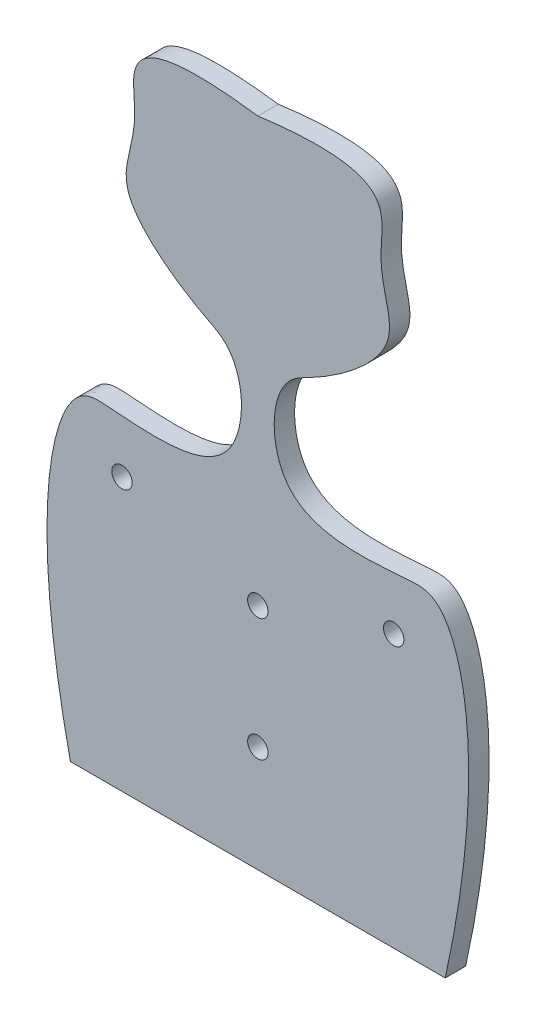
ISO-10303-21;
HEADER;
FILE_DESCRIPTION(('STEP AP214'),'2;1');
FILE_NAME('part.step','',(''),(''),'','','');
FILE_SCHEMA(('AUTOMOTIVE_DESIGN { 1 0 10303 214 1 1 1 1 }'));
ENDSEC;
DATA;
#1=APPLICATION_CONTEXT('core data for automotive mechanical design processes');
#2=APPLICATION_PROTOCOL_DEFINITION('international standard','automotive_design',2000,#1);
#3=PRODUCT_CONTEXT('',#1,'mechanical');
#4=PRODUCT('Part','Part','',(#3));
#5=PRODUCT_RELATED_PRODUCT_CATEGORY('part','',(#4));
#6=PRODUCT_DEFINITION_FORMATION('','',#4);
#7=PRODUCT_DEFINITION_CONTEXT('part definition',#1,'design');
#8=PRODUCT_DEFINITION('design','',#6,#7);
#9=PRODUCT_DEFINITION_SHAPE('','',#8);
#10=(LENGTH_UNIT() NAMED_UNIT(*) SI_UNIT(.MILLI.,.METRE.));
#11=(NAMED_UNIT(*) PLANE_ANGLE_UNIT() SI_UNIT($,.RADIAN.));
#12=(NAMED_UNIT(*) SI_UNIT($,.STERADIAN.) SOLID_ANGLE_UNIT());
#13=UNCERTAINTY_MEASURE_WITH_UNIT(LENGTH_MEASURE(1.E-05),#10,'distance_accuracy_value','');
#14=(GEOMETRIC_REPRESENTATION_CONTEXT(3) GLOBAL_UNCERTAINTY_ASSIGNED_CONTEXT((#13)) GLOBAL_UNIT_ASSIGNED_CONTEXT((#10,
#11,#12)) REPRESENTATION_CONTEXT('',''));
#15=CARTESIAN_POINT('',(0.,0.,0.));
#16=DIRECTION('',(0.,0.,1.));
#17=DIRECTION('',(1.,0.,0.));
#18=AXIS2_PLACEMENT_3D('',#15,#16,#17);
#19=CARTESIAN_POINT('',(7.7262015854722,70.2212811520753,3.175));
#20=DIRECTION('',(0.,0.,1.));
#21=DIRECTION('',(1.,0.,0.));
#22=AXIS2_PLACEMENT_3D('',#19,#20,#21);
#23=PLANE('',#22);
#24=CARTESIAN_POINT('',(0.,35.600944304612,3.175));
#25=DIRECTION('',(0.,0.,1.));
#26=DIRECTION('',(1.,0.,0.));
#27=AXIS2_PLACEMENT_3D('',#24,#25,#26);
#28=CIRCLE('',#27,1.5875);
#29=CARTESIAN_POINT('',(1.5875,35.600944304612,3.175));
#30=VERTEX_POINT('',#29);
#31=EDGE_CURVE('E128',#30,#30,#28,.T.);
#32=ORIENTED_EDGE('',*,*,#31,.F.);
#33=EDGE_LOOP('',(#32));
#34=FACE_BOUND('',#33,.T.);
#35=CARTESIAN_POINT('',(-21.1456586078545,42.3709194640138,3.175));
#36=DIRECTION('',(0.,0.,1.));
#37=DIRECTION('',(1.,0.,0.));
#38=AXIS2_PLACEMENT_3D('',#35,#36,#37);
#39=CIRCLE('',#38,1.5875);
#40=CARTESIAN_POINT('',(-19.5581586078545,42.3709194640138,3.175));
#41=VERTEX_POINT('',#40);
#42=EDGE_CURVE('E84',#41,#41,#39,.T.);
#43=ORIENTED_EDGE('',*,*,#42,.F.);
#44=EDGE_LOOP('',(#43));
#45=FACE_BOUND('',#44,.T.);
#46=CARTESIAN_POINT('',(29.1666343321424,-8.65942256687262E-13,3.175));
#47=CARTESIAN_POINT('',(35.7628200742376,30.0088314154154,3.175));
#48=CARTESIAN_POINT('',(31.5236699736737,51.224595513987,3.175));
#49=CARTESIAN_POINT('',(18.7049477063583,50.5697515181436,3.175));
#50=CARTESIAN_POINT('',(1.65675990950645,48.4831622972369,3.175));
#51=CARTESIAN_POINT('',(1.89632446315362,67.4471122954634,3.175));
#52=CARTESIAN_POINT('',(12.5671073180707,72.4731275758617,3.175));
#53=CARTESIAN_POINT('',(23.8531928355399,81.8796354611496,3.175));
#54=CARTESIAN_POINT('',(18.635797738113,87.6877501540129,3.175));
#55=CARTESIAN_POINT('',(19.6315774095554,98.3379837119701,3.175));
#56=CARTESIAN_POINT('',(18.872778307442,104.13240078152,3.175));
#57=CARTESIAN_POINT('',(0.,101.6,3.175));
#58=B_SPLINE_CURVE_WITH_KNOTS('',3,(#46,#47,#48,#49,#50,#51,#52,#53,#54,#55,#56,#57),
.UNSPECIFIED.,.F.,.F.,(4,1,1,1,1,1,1,1,1,4),(0.,0.150827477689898,0.186615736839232,
0.357882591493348,0.475953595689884,0.505327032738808,0.651616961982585,0.839524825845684,
0.874363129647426,1.),.UNSPECIFIED.);
#59=CARTESIAN_POINT('',(29.1666343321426,0.,3.175));
#60=VERTEX_POINT('',#59);
#61=CARTESIAN_POINT('',(0.,101.6,3.175));
#62=VERTEX_POINT('',#61);
#63=EDGE_CURVE('E75',#60,#62,#58,.T.);
#64=ORIENTED_EDGE('',*,*,#63,.T.);
#65=CARTESIAN_POINT('',(0.,101.6,3.175));
#66=CARTESIAN_POINT('',(-18.872778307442,104.13240078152,3.175));
#67=CARTESIAN_POINT('',(-19.6315774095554,98.3379837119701,3.175));
#68=CARTESIAN_POINT('',(-18.635797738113,87.6877501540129,3.175));
#69=CARTESIAN_POINT('',(-23.8531928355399,81.8796354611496,3.175));
#70=CARTESIAN_POINT('',(-12.5671073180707,72.4731275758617,3.175));
#71=CARTESIAN_POINT('',(-1.89632446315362,67.4471122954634,3.175));
#72=CARTESIAN_POINT('',(-1.65675990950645,48.4831622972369,3.175));
#73=CARTESIAN_POINT('',(-18.7049477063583,50.5697515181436,3.175));
#74=CARTESIAN_POINT('',(-31.5236699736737,51.224595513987,3.175));
#75=CARTESIAN_POINT('',(-35.7628200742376,30.0088314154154,3.175));
#76=CARTESIAN_POINT('',(-29.1666343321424,-8.65942256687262E-13,3.175));
#77=B_SPLINE_CURVE_WITH_KNOTS('',3,(#65,#66,#67,#68,#69,#70,#71,#72,#73,#74,#75,#76),
.UNSPECIFIED.,.F.,.F.,(4,1,1,1,1,1,1,1,1,4),(0.,0.125636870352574,0.160475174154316,
0.348383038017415,0.494672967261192,0.524046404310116,0.642117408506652,0.813384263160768,
0.849172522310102,1.),.UNSPECIFIED.);
#78=CARTESIAN_POINT('',(-29.1666343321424,-8.65942256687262E-13,3.175));
#79=VERTEX_POINT('',#78);
#80=EDGE_CURVE('E71',#62,#79,#77,.T.);
#81=ORIENTED_EDGE('',*,*,#80,.T.);
#82=DIRECTION('',(1.,0.,0.));
#83=VECTOR('',#82,1.);
#84=CARTESIAN_POINT('',(-29.1666343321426,0.,3.175));
#85=LINE('',#84,#83);
#86=EDGE_CURVE('E51',#79,#60,#85,.T.);
#87=ORIENTED_EDGE('',*,*,#86,.T.);
#88=EDGE_LOOP('',(#64,#81,#87));
#89=FACE_BOUND('',#88,.T.);
#90=CARTESIAN_POINT('',(21.1456586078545,42.3709194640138,3.175));
#91=DIRECTION('',(0.,0.,1.));
#92=DIRECTION('',(-1.,0.,0.));
#93=AXIS2_PLACEMENT_3D('',#90,#91,#92);
#94=CIRCLE('',#93,1.5875);
#95=CARTESIAN_POINT('',(19.5581586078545,42.3709194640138,3.175));
#96=VERTEX_POINT('',#95);
#97=EDGE_CURVE('E132',#96,#96,#94,.T.);
#98=ORIENTED_EDGE('',*,*,#97,.F.);
#99=EDGE_LOOP('',(#98));
#100=FACE_BOUND('',#99,.T.);
#101=CARTESIAN_POINT('',(0.,16.550944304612,3.175));
#102=DIRECTION('',(0.,0.,1.));
#103=DIRECTION('',(1.,0.,0.));
#104=AXIS2_PLACEMENT_3D('',#101,#102,#103);
#105=CIRCLE('',#104,1.5875);
#106=CARTESIAN_POINT('',(1.5875,16.550944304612,3.175));
#107=VERTEX_POINT('',#106);
#108=EDGE_CURVE('E123',#107,#107,#105,.T.);
#109=ORIENTED_EDGE('',*,*,#108,.F.);
#110=EDGE_LOOP('',(#109));
#111=FACE_BOUND('',#110,.T.);
#112=ADVANCED_FACE('F33',(#34,#45,#89,#100,#111),#23,.T.);
#113=CARTESIAN_POINT('',(7.7262015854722,70.2212811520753,0.));
#114=DIRECTION('',(0.,0.,1.));
#115=DIRECTION('',(1.,0.,0.));
#116=AXIS2_PLACEMENT_3D('',#113,#114,#115);
#117=PLANE('',#116);
#118=CARTESIAN_POINT('',(29.1666343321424,-8.65942256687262E-13,0.));
#119=CARTESIAN_POINT('',(35.7628200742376,30.0088314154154,0.));
#120=CARTESIAN_POINT('',(31.5236699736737,51.224595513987,0.));
#121=CARTESIAN_POINT('',(18.7049477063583,50.5697515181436,0.));
#122=CARTESIAN_POINT('',(1.65675990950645,48.4831622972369,0.));
#123=CARTESIAN_POINT('',(1.89632446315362,67.4471122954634,0.));
#124=CARTESIAN_POINT('',(12.5671073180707,72.4731275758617,0.));
#125=CARTESIAN_POINT('',(23.8531928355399,81.8796354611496,0.));
#126=CARTESIAN_POINT('',(18.635797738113,87.6877501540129,0.));
#127=CARTESIAN_POINT('',(19.6315774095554,98.3379837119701,0.));
#128=CARTESIAN_POINT('',(18.872778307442,104.13240078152,0.));
#129=CARTESIAN_POINT('',(0.,101.6,0.));
#130=B_SPLINE_CURVE_WITH_KNOTS('',3,(#118,#119,#120,#121,#122,#123,#124,#125,#126,#127,#128,
#129),.UNSPECIFIED.,.F.,.F.,(4,1,1,1,1,1,1,1,1,4),(0.,0.150827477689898,0.186615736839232,
0.357882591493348,0.475953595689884,0.505327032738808,0.651616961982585,0.839524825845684,
0.874363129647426,1.),.UNSPECIFIED.);
#131=CARTESIAN_POINT('',(29.1666343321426,0.,0.));
#132=VERTEX_POINT('',#131);
#133=CARTESIAN_POINT('',(0.,101.6,0.));
#134=VERTEX_POINT('',#133);
#135=EDGE_CURVE('E81',#132,#134,#130,.T.);
#136=ORIENTED_EDGE('',*,*,#135,.F.);
#137=DIRECTION('',(1.,0.,0.));
#138=VECTOR('',#137,1.);
#139=CARTESIAN_POINT('',(-29.1666343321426,0.,0.));
#140=LINE('',#139,#138);
#141=CARTESIAN_POINT('',(-29.1666343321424,-8.65942256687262E-13,0.));
#142=VERTEX_POINT('',#141);
#143=EDGE_CURVE('E68',#142,#132,#140,.T.);
#144=ORIENTED_EDGE('',*,*,#143,.F.);
#145=CARTESIAN_POINT('',(0.,101.6,0.));
#146=CARTESIAN_POINT('',(-18.872778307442,104.13240078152,0.));
#147=CARTESIAN_POINT('',(-19.6315774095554,98.3379837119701,0.));
#148=CARTESIAN_POINT('',(-18.635797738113,87.6877501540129,0.));
#149=CARTESIAN_POINT('',(-23.8531928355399,81.8796354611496,0.));
#150=CARTESIAN_POINT('',(-12.5671073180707,72.4731275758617,0.));
#151=CARTESIAN_POINT('',(-1.89632446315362,67.4471122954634,0.));
#152=CARTESIAN_POINT('',(-1.65675990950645,48.4831622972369,0.));
#153=CARTESIAN_POINT('',(-18.7049477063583,50.5697515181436,0.));
#154=CARTESIAN_POINT('',(-31.5236699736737,51.224595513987,0.));
#155=CARTESIAN_POINT('',(-35.7628200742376,30.0088314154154,0.));
#156=CARTESIAN_POINT('',(-29.1666343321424,-8.65942256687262E-13,0.));
#157=B_SPLINE_CURVE_WITH_KNOTS('',3,(#145,#146,#147,#148,#149,#150,#151,#152,#153,#154,#155,
#156),.UNSPECIFIED.,.F.,.F.,(4,1,1,1,1,1,1,1,1,4),(0.,0.125636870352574,0.160475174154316,
0.348383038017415,0.494672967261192,0.524046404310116,0.642117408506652,0.813384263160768,
0.849172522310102,1.),.UNSPECIFIED.);
#158=EDGE_CURVE('E63',#134,#142,#157,.T.);
#159=ORIENTED_EDGE('',*,*,#158,.F.);
#160=EDGE_LOOP('',(#136,#144,#159));
#161=FACE_BOUND('',#160,.T.);
#162=CARTESIAN_POINT('',(-21.1456586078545,42.3709194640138,0.));
#163=DIRECTION('',(0.,0.,1.));
#164=DIRECTION('',(1.,0.,0.));
#165=AXIS2_PLACEMENT_3D('',#162,#163,#164);
#166=CIRCLE('',#165,1.5875);
#167=CARTESIAN_POINT('',(-19.5581586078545,42.3709194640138,0.));
#168=VERTEX_POINT('',#167);
#169=EDGE_CURVE('E88',#168,#168,#166,.T.);
#170=ORIENTED_EDGE('',*,*,#169,.T.);
#171=EDGE_LOOP('',(#170));
#172=FACE_BOUND('',#171,.T.);
#173=CARTESIAN_POINT('',(21.1456586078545,42.3709194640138,0.));
#174=DIRECTION('',(0.,0.,1.));
#175=DIRECTION('',(-1.,0.,0.));
#176=AXIS2_PLACEMENT_3D('',#173,#174,#175);
#177=CIRCLE('',#176,1.5875);
#178=CARTESIAN_POINT('',(19.5581586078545,42.3709194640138,0.));
#179=VERTEX_POINT('',#178);
#180=EDGE_CURVE('E114',#179,#179,#177,.T.);
#181=ORIENTED_EDGE('',*,*,#180,.T.);
#182=EDGE_LOOP('',(#181));
#183=FACE_BOUND('',#182,.T.);
#184=CARTESIAN_POINT('',(0.,35.600944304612,0.));
#185=DIRECTION('',(0.,0.,1.));
#186=DIRECTION('',(1.,0.,0.));
#187=AXIS2_PLACEMENT_3D('',#184,#185,#186);
#188=CIRCLE('',#187,1.5875);
#189=CARTESIAN_POINT('',(1.5875,35.600944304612,0.));
#190=VERTEX_POINT('',#189);
#191=EDGE_CURVE('E118',#190,#190,#188,.T.);
#192=ORIENTED_EDGE('',*,*,#191,.T.);
#193=EDGE_LOOP('',(#192));
#194=FACE_BOUND('',#193,.T.);
#195=CARTESIAN_POINT('',(0.,16.550944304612,0.));
#196=DIRECTION('',(0.,0.,1.));
#197=DIRECTION('',(1.,0.,0.));
#198=AXIS2_PLACEMENT_3D('',#195,#196,#197);
#199=CIRCLE('',#198,1.5875);
#200=CARTESIAN_POINT('',(1.5875,16.550944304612,0.));
#201=VERTEX_POINT('',#200);
#202=EDGE_CURVE('E121',#201,#201,#199,.T.);
#203=ORIENTED_EDGE('',*,*,#202,.T.);
#204=EDGE_LOOP('',(#203));
#205=FACE_BOUND('',#204,.T.);
#206=ADVANCED_FACE('F104',(#161,#172,#183,#194,#205),#117,.F.);
#207=DIRECTION('',(0.,0.,-1.));
#208=VECTOR('',#207,1.);
#209=SURFACE_OF_LINEAR_EXTRUSION('',#58,#208);
#210=ORIENTED_EDGE('',*,*,#135,.T.);
#211=DIRECTION('',(0.,0.,-1.));
#212=VECTOR('',#211,1.);
#213=CARTESIAN_POINT('',(0.,101.6,3.175));
#214=LINE('',#213,#212);
#215=EDGE_CURVE('E11',#62,#134,#214,.T.);
#216=ORIENTED_EDGE('',*,*,#215,.F.);
#217=ORIENTED_EDGE('',*,*,#63,.F.);
#218=DIRECTION('',(0.,0.,-1.));
#219=VECTOR('',#218,1.);
#220=CARTESIAN_POINT('',(29.1666343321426,0.,3.175));
#221=LINE('',#220,#219);
#222=EDGE_CURVE('E82',#60,#132,#221,.T.);
#223=ORIENTED_EDGE('',*,*,#222,.T.);
#224=EDGE_LOOP('',(#210,#216,#217,#223));
#225=FACE_BOUND('',#224,.T.);
#226=ADVANCED_FACE('F35',(#225),#209,.F.);
#227=DIRECTION('',(0.,0.,-1.));
#228=VECTOR('',#227,1.);
#229=SURFACE_OF_LINEAR_EXTRUSION('',#77,#228);
#230=ORIENTED_EDGE('',*,*,#158,.T.);
#231=DIRECTION('',(0.,0.,-1.));
#232=VECTOR('',#231,1.);
#233=CARTESIAN_POINT('',(-29.1666343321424,-8.65942256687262E-13,3.175));
#234=LINE('',#233,#232);
#235=EDGE_CURVE('E43',#79,#142,#234,.T.);
#236=ORIENTED_EDGE('',*,*,#235,.F.);
#237=ORIENTED_EDGE('',*,*,#80,.F.);
#238=ORIENTED_EDGE('',*,*,#215,.T.);
#239=EDGE_LOOP('',(#230,#236,#237,#238));
#240=FACE_BOUND('',#239,.T.);
#241=ADVANCED_FACE('F72',(#240),#229,.F.);
#242=CARTESIAN_POINT('',(-29.1666343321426,0.,3.175));
#243=DIRECTION('',(0.,1.,0.));
#244=DIRECTION('',(0.,0.,1.));
#245=AXIS2_PLACEMENT_3D('',#242,#243,#244);
#246=PLANE('',#245);
#247=ORIENTED_EDGE('',*,*,#143,.T.);
#248=ORIENTED_EDGE('',*,*,#222,.F.);
#249=ORIENTED_EDGE('',*,*,#86,.F.);
#250=ORIENTED_EDGE('',*,*,#235,.T.);
#251=EDGE_LOOP('',(#247,#248,#249,#250));
#252=FACE_BOUND('',#251,.T.);
#253=ADVANCED_FACE('F103',(#252),#246,.F.);
#254=CARTESIAN_POINT('',(-21.1456586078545,42.3709194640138,3.175));
#255=DIRECTION('',(0.,0.,-1.));
#256=DIRECTION('',(-1.,0.,0.));
#257=AXIS2_PLACEMENT_3D('',#254,#255,#256);
#258=CYLINDRICAL_SURFACE('',#257,1.5875);
#259=ORIENTED_EDGE('',*,*,#42,.T.);
#260=EDGE_LOOP('',(#259));
#261=FACE_BOUND('',#260,.T.);
#262=ORIENTED_EDGE('',*,*,#169,.F.);
#263=EDGE_LOOP('',(#262));
#264=FACE_BOUND('',#263,.T.);
#265=ADVANCED_FACE('F151',(#261,#264),#258,.F.);
#266=CARTESIAN_POINT('',(21.1456586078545,42.3709194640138,3.175));
#267=DIRECTION('',(0.,0.,-1.));
#268=DIRECTION('',(-1.,0.,0.));
#269=AXIS2_PLACEMENT_3D('',#266,#267,#268);
#270=CYLINDRICAL_SURFACE('',#269,1.5875);
#271=ORIENTED_EDGE('',*,*,#97,.T.);
#272=EDGE_LOOP('',(#271));
#273=FACE_BOUND('',#272,.T.);
#274=ORIENTED_EDGE('',*,*,#180,.F.);
#275=EDGE_LOOP('',(#274));
#276=FACE_BOUND('',#275,.T.);
#277=ADVANCED_FACE('F158',(#273,#276),#270,.F.);
#278=CARTESIAN_POINT('',(0.,35.600944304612,3.175));
#279=DIRECTION('',(0.,0.,-1.));
#280=DIRECTION('',(-1.,0.,0.));
#281=AXIS2_PLACEMENT_3D('',#278,#279,#280);
#282=CYLINDRICAL_SURFACE('',#281,1.5875);
#283=ORIENTED_EDGE('',*,*,#31,.T.);
#284=EDGE_LOOP('',(#283));
#285=FACE_BOUND('',#284,.T.);
#286=ORIENTED_EDGE('',*,*,#191,.F.);
#287=EDGE_LOOP('',(#286));
#288=FACE_BOUND('',#287,.T.);
#289=ADVANCED_FACE('F162',(#285,#288),#282,.F.);
#290=CARTESIAN_POINT('',(0.,16.550944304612,3.175));
#291=DIRECTION('',(0.,0.,-1.));
#292=DIRECTION('',(-1.,0.,0.));
#293=AXIS2_PLACEMENT_3D('',#290,#291,#292);
#294=CYLINDRICAL_SURFACE('',#293,1.5875);
#295=ORIENTED_EDGE('',*,*,#108,.T.);
#296=EDGE_LOOP('',(#295));
#297=FACE_BOUND('',#296,.T.);
#298=ORIENTED_EDGE('',*,*,#202,.F.);
#299=EDGE_LOOP('',(#298));
#300=FACE_BOUND('',#299,.T.);
#301=ADVANCED_FACE('F166',(#297,#300),#294,.F.);
#302=CLOSED_SHELL('',(#112,#206,#226,#241,#253,#265,#277,#289,#301));
#303=MANIFOLD_SOLID_BREP('B2',#302);
#304=ADVANCED_BREP_SHAPE_REPRESENTATION('',(#18,#303),#14);
#305=SHAPE_DEFINITION_REPRESENTATION(#9,#304);
ENDSEC;
END-ISO-10303-21;
